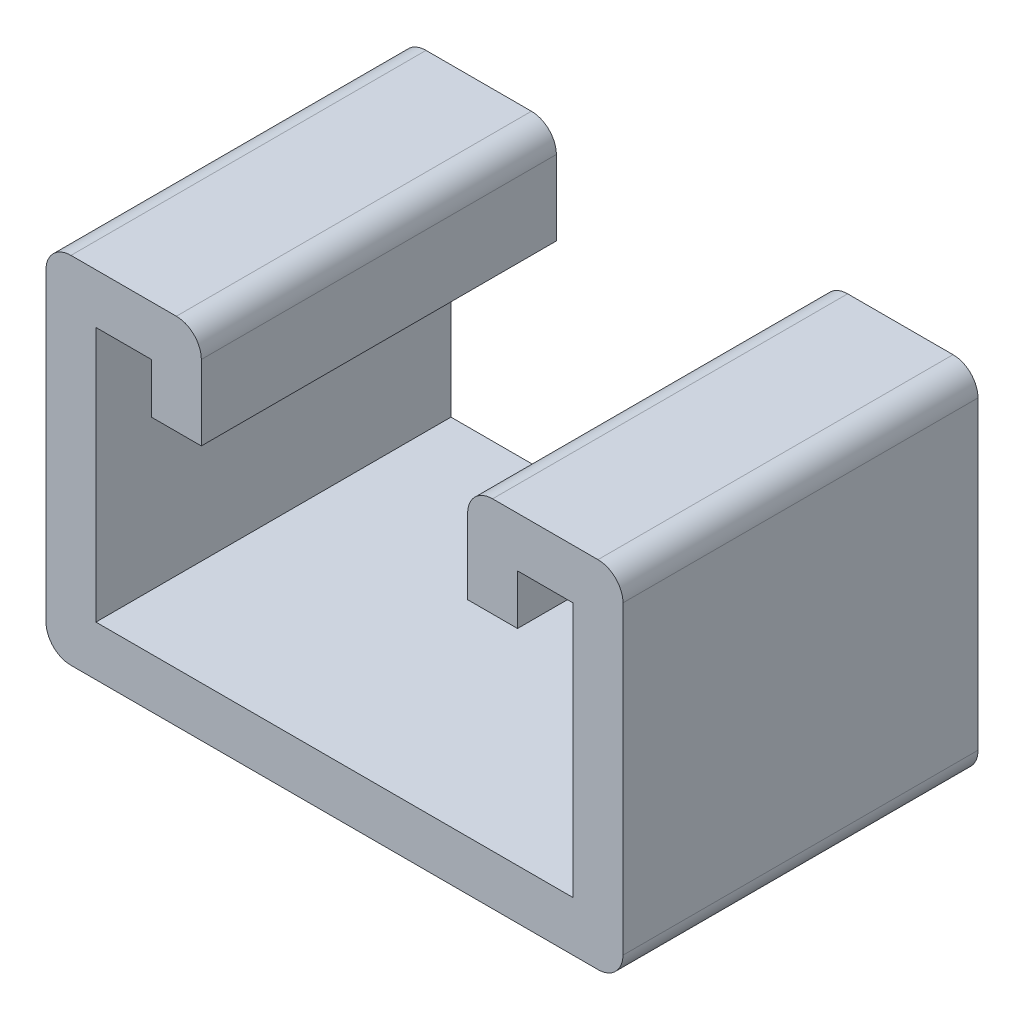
ISO-10303-21;
HEADER;
FILE_DESCRIPTION(('STEP AP214'),'2;1');
FILE_NAME('part.step','',(''),(''),'','','');
FILE_SCHEMA(('AUTOMOTIVE_DESIGN { 1 0 10303 214 1 1 1 1 }'));
ENDSEC;
DATA;
#1=APPLICATION_CONTEXT('core data for automotive mechanical design processes');
#2=APPLICATION_PROTOCOL_DEFINITION('international standard','automotive_design',2000,#1);
#3=PRODUCT_CONTEXT('',#1,'mechanical');
#4=PRODUCT('Part','Part','',(#3));
#5=PRODUCT_RELATED_PRODUCT_CATEGORY('part','',(#4));
#6=PRODUCT_DEFINITION_FORMATION('','',#4);
#7=PRODUCT_DEFINITION_CONTEXT('part definition',#1,'design');
#8=PRODUCT_DEFINITION('design','',#6,#7);
#9=PRODUCT_DEFINITION_SHAPE('','',#8);
#10=(LENGTH_UNIT() NAMED_UNIT(*) SI_UNIT(.MILLI.,.METRE.));
#11=(NAMED_UNIT(*) PLANE_ANGLE_UNIT() SI_UNIT($,.RADIAN.));
#12=(NAMED_UNIT(*) SI_UNIT($,.STERADIAN.) SOLID_ANGLE_UNIT());
#13=UNCERTAINTY_MEASURE_WITH_UNIT(LENGTH_MEASURE(1.E-05),#10,'distance_accuracy_value','');
#14=(GEOMETRIC_REPRESENTATION_CONTEXT(3) GLOBAL_UNCERTAINTY_ASSIGNED_CONTEXT((#13)) GLOBAL_UNIT_ASSIGNED_CONTEXT((#10,
#11,#12)) REPRESENTATION_CONTEXT('',''));
#15=CARTESIAN_POINT('',(0.,0.,0.));
#16=DIRECTION('',(0.,0.,1.));
#17=DIRECTION('',(1.,0.,0.));
#18=AXIS2_PLACEMENT_3D('',#15,#16,#17);
#19=CARTESIAN_POINT('',(9.525,5.55625,12.7));
#20=DIRECTION('',(0.,1.,0.));
#21=DIRECTION('',(0.,0.,1.));
#22=AXIS2_PLACEMENT_3D('',#19,#20,#21);
#23=PLANE('',#22);
#24=DIRECTION('',(1.,0.,0.));
#25=VECTOR('',#24,1.);
#26=CARTESIAN_POINT('',(9.525,5.55625,-12.7));
#27=LINE('',#26,#25);
#28=CARTESIAN_POINT('',(9.525,5.55625,-12.7));
#29=VERTEX_POINT('',#28);
#30=CARTESIAN_POINT('',(13.096875,5.55625,-12.7));
#31=VERTEX_POINT('',#30);
#32=EDGE_CURVE('E212',#29,#31,#27,.T.);
#33=ORIENTED_EDGE('',*,*,#32,.T.);
#34=DIRECTION('',(0.,0.,-1.));
#35=VECTOR('',#34,1.);
#36=CARTESIAN_POINT('',(13.096875,5.55625,12.7));
#37=LINE('',#36,#35);
#38=CARTESIAN_POINT('',(13.096875,5.55625,12.7));
#39=VERTEX_POINT('',#38);
#40=EDGE_CURVE('E11',#39,#31,#37,.T.);
#41=ORIENTED_EDGE('',*,*,#40,.F.);
#42=DIRECTION('',(1.,0.,0.));
#43=VECTOR('',#42,1.);
#44=CARTESIAN_POINT('',(9.525,5.55625,12.7));
#45=LINE('',#44,#43);
#46=CARTESIAN_POINT('',(9.525,5.55625,12.7));
#47=VERTEX_POINT('',#46);
#48=EDGE_CURVE('E254',#47,#39,#45,.T.);
#49=ORIENTED_EDGE('',*,*,#48,.F.);
#50=DIRECTION('',(0.,0.,-1.));
#51=VECTOR('',#50,1.);
#52=CARTESIAN_POINT('',(9.525,5.55625,12.7));
#53=LINE('',#52,#51);
#54=EDGE_CURVE('E208',#47,#29,#53,.T.);
#55=ORIENTED_EDGE('',*,*,#54,.T.);
#56=EDGE_LOOP('',(#33,#41,#49,#55));
#57=FACE_BOUND('',#56,.T.);
#58=ADVANCED_FACE('F32',(#57),#23,.F.);
#59=CARTESIAN_POINT('',(13.096875,9.128125,12.7));
#60=DIRECTION('',(-1.,0.,0.));
#61=DIRECTION('',(0.,0.,1.));
#62=AXIS2_PLACEMENT_3D('',#59,#60,#61);
#63=PLANE('',#62);
#64=DIRECTION('',(0.,1.,0.));
#65=VECTOR('',#64,1.);
#66=CARTESIAN_POINT('',(13.096875,9.128125,-12.7));
#67=LINE('',#66,#65);
#68=CARTESIAN_POINT('',(13.096875,9.128125,-12.7));
#69=VERTEX_POINT('',#68);
#70=EDGE_CURVE('E215',#31,#69,#67,.T.);
#71=ORIENTED_EDGE('',*,*,#70,.T.);
#72=DIRECTION('',(0.,0.,-1.));
#73=VECTOR('',#72,1.);
#74=CARTESIAN_POINT('',(13.096875,9.128125,12.7));
#75=LINE('',#74,#73);
#76=CARTESIAN_POINT('',(13.096875,9.128125,12.7));
#77=VERTEX_POINT('',#76);
#78=EDGE_CURVE('E40',#77,#69,#75,.T.);
#79=ORIENTED_EDGE('',*,*,#78,.F.);
#80=DIRECTION('',(0.,1.,0.));
#81=VECTOR('',#80,1.);
#82=CARTESIAN_POINT('',(13.096875,9.128125,12.7));
#83=LINE('',#82,#81);
#84=EDGE_CURVE('E133',#39,#77,#83,.T.);
#85=ORIENTED_EDGE('',*,*,#84,.F.);
#86=ORIENTED_EDGE('',*,*,#40,.T.);
#87=EDGE_LOOP('',(#71,#79,#85,#86));
#88=FACE_BOUND('',#87,.T.);
#89=ADVANCED_FACE('F382',(#88),#63,.F.);
#90=CARTESIAN_POINT('',(17.065625,9.128125,12.7));
#91=DIRECTION('',(0.,1.,0.));
#92=DIRECTION('',(0.,0.,1.));
#93=AXIS2_PLACEMENT_3D('',#90,#91,#92);
#94=PLANE('',#93);
#95=DIRECTION('',(1.,0.,0.));
#96=VECTOR('',#95,1.);
#97=CARTESIAN_POINT('',(17.065625,9.128125,-12.7));
#98=LINE('',#97,#96);
#99=CARTESIAN_POINT('',(17.065625,9.128125,-12.7));
#100=VERTEX_POINT('',#99);
#101=EDGE_CURVE('E217',#69,#100,#98,.T.);
#102=ORIENTED_EDGE('',*,*,#101,.T.);
#103=DIRECTION('',(0.,0.,-1.));
#104=VECTOR('',#103,1.);
#105=CARTESIAN_POINT('',(17.065625,9.128125,12.7));
#106=LINE('',#105,#104);
#107=CARTESIAN_POINT('',(17.065625,9.128125,12.7));
#108=VERTEX_POINT('',#107);
#109=EDGE_CURVE('E303',#108,#100,#106,.T.);
#110=ORIENTED_EDGE('',*,*,#109,.F.);
#111=DIRECTION('',(1.,0.,0.));
#112=VECTOR('',#111,1.);
#113=CARTESIAN_POINT('',(17.065625,9.128125,12.7));
#114=LINE('',#113,#112);
#115=EDGE_CURVE('E311',#77,#108,#114,.T.);
#116=ORIENTED_EDGE('',*,*,#115,.F.);
#117=ORIENTED_EDGE('',*,*,#78,.T.);
#118=EDGE_LOOP('',(#102,#110,#116,#117));
#119=FACE_BOUND('',#118,.T.);
#120=ADVANCED_FACE('F309',(#119),#94,.F.);
#121=CARTESIAN_POINT('',(17.065625,-9.128125,12.7));
#122=DIRECTION('',(1.,0.,0.));
#123=DIRECTION('',(0.,1.,0.));
#124=AXIS2_PLACEMENT_3D('',#121,#122,#123);
#125=PLANE('',#124);
#126=DIRECTION('',(0.,-1.,0.));
#127=VECTOR('',#126,1.);
#128=CARTESIAN_POINT('',(17.065625,-9.128125,-12.7));
#129=LINE('',#128,#127);
#130=CARTESIAN_POINT('',(17.065625,-9.128125,-12.7));
#131=VERTEX_POINT('',#130);
#132=EDGE_CURVE('E219',#100,#131,#129,.T.);
#133=ORIENTED_EDGE('',*,*,#132,.T.);
#134=DIRECTION('',(0.,0.,-1.));
#135=VECTOR('',#134,1.);
#136=CARTESIAN_POINT('',(17.065625,-9.128125,12.7));
#137=LINE('',#136,#135);
#138=CARTESIAN_POINT('',(17.065625,-9.128125,12.7));
#139=VERTEX_POINT('',#138);
#140=EDGE_CURVE('E300',#139,#131,#137,.T.);
#141=ORIENTED_EDGE('',*,*,#140,.F.);
#142=DIRECTION('',(0.,-1.,0.));
#143=VECTOR('',#142,1.);
#144=CARTESIAN_POINT('',(17.065625,-9.128125,12.7));
#145=LINE('',#144,#143);
#146=EDGE_CURVE('E329',#108,#139,#145,.T.);
#147=ORIENTED_EDGE('',*,*,#146,.F.);
#148=ORIENTED_EDGE('',*,*,#109,.T.);
#149=EDGE_LOOP('',(#133,#141,#147,#148));
#150=FACE_BOUND('',#149,.T.);
#151=ADVANCED_FACE('F320',(#150),#125,.F.);
#152=CARTESIAN_POINT('',(-17.065625,-9.128125,12.7));
#153=DIRECTION('',(0.,-1.,0.));
#154=DIRECTION('',(0.,0.,-1.));
#155=AXIS2_PLACEMENT_3D('',#152,#153,#154);
#156=PLANE('',#155);
#157=DIRECTION('',(-1.,0.,0.));
#158=VECTOR('',#157,1.);
#159=CARTESIAN_POINT('',(-17.065625,-9.128125,-12.7));
#160=LINE('',#159,#158);
#161=CARTESIAN_POINT('',(-17.065625,-9.128125,-12.7));
#162=VERTEX_POINT('',#161);
#163=EDGE_CURVE('E221',#131,#162,#160,.T.);
#164=ORIENTED_EDGE('',*,*,#163,.T.);
#165=DIRECTION('',(0.,0.,-1.));
#166=VECTOR('',#165,1.);
#167=CARTESIAN_POINT('',(-17.065625,-9.128125,12.7));
#168=LINE('',#167,#166);
#169=CARTESIAN_POINT('',(-17.065625,-9.128125,12.7));
#170=VERTEX_POINT('',#169);
#171=EDGE_CURVE('E297',#170,#162,#168,.T.);
#172=ORIENTED_EDGE('',*,*,#171,.F.);
#173=DIRECTION('',(-1.,0.,0.));
#174=VECTOR('',#173,1.);
#175=CARTESIAN_POINT('',(-17.065625,-9.128125,12.7));
#176=LINE('',#175,#174);
#177=EDGE_CURVE('E326',#139,#170,#176,.T.);
#178=ORIENTED_EDGE('',*,*,#177,.F.);
#179=ORIENTED_EDGE('',*,*,#140,.T.);
#180=EDGE_LOOP('',(#164,#172,#178,#179));
#181=FACE_BOUND('',#180,.T.);
#182=ADVANCED_FACE('F324',(#181),#156,.F.);
#183=CARTESIAN_POINT('',(-17.065625,9.128125,12.7));
#184=DIRECTION('',(-1.,0.,0.));
#185=DIRECTION('',(0.,-1.,0.));
#186=AXIS2_PLACEMENT_3D('',#183,#184,#185);
#187=PLANE('',#186);
#188=DIRECTION('',(0.,1.,0.));
#189=VECTOR('',#188,1.);
#190=CARTESIAN_POINT('',(-17.065625,9.128125,-12.7));
#191=LINE('',#190,#189);
#192=CARTESIAN_POINT('',(-17.065625,9.128125,-12.7));
#193=VERTEX_POINT('',#192);
#194=EDGE_CURVE('E223',#162,#193,#191,.T.);
#195=ORIENTED_EDGE('',*,*,#194,.T.);
#196=DIRECTION('',(0.,0.,-1.));
#197=VECTOR('',#196,1.);
#198=CARTESIAN_POINT('',(-17.065625,9.128125,12.7));
#199=LINE('',#198,#197);
#200=CARTESIAN_POINT('',(-17.065625,9.128125,12.7));
#201=VERTEX_POINT('',#200);
#202=EDGE_CURVE('E294',#201,#193,#199,.T.);
#203=ORIENTED_EDGE('',*,*,#202,.F.);
#204=DIRECTION('',(0.,1.,0.));
#205=VECTOR('',#204,1.);
#206=CARTESIAN_POINT('',(-17.065625,9.128125,12.7));
#207=LINE('',#206,#205);
#208=EDGE_CURVE('E328',#170,#201,#207,.T.);
#209=ORIENTED_EDGE('',*,*,#208,.F.);
#210=ORIENTED_EDGE('',*,*,#171,.T.);
#211=EDGE_LOOP('',(#195,#203,#209,#210));
#212=FACE_BOUND('',#211,.T.);
#213=ADVANCED_FACE('F395',(#212),#187,.F.);
#214=CARTESIAN_POINT('',(-13.096875,9.128125,12.7));
#215=DIRECTION('',(0.,1.,0.));
#216=DIRECTION('',(0.,0.,1.));
#217=AXIS2_PLACEMENT_3D('',#214,#215,#216);
#218=PLANE('',#217);
#219=DIRECTION('',(1.,0.,0.));
#220=VECTOR('',#219,1.);
#221=CARTESIAN_POINT('',(-13.096875,9.128125,-12.7));
#222=LINE('',#221,#220);
#223=CARTESIAN_POINT('',(-13.096875,9.128125,-12.7));
#224=VERTEX_POINT('',#223);
#225=EDGE_CURVE('E225',#193,#224,#222,.T.);
#226=ORIENTED_EDGE('',*,*,#225,.T.);
#227=DIRECTION('',(0.,0.,-1.));
#228=VECTOR('',#227,1.);
#229=CARTESIAN_POINT('',(-13.096875,9.128125,12.7));
#230=LINE('',#229,#228);
#231=CARTESIAN_POINT('',(-13.096875,9.128125,12.7));
#232=VERTEX_POINT('',#231);
#233=EDGE_CURVE('E291',#232,#224,#230,.T.);
#234=ORIENTED_EDGE('',*,*,#233,.F.);
#235=DIRECTION('',(1.,0.,0.));
#236=VECTOR('',#235,1.);
#237=CARTESIAN_POINT('',(-13.096875,9.128125,12.7));
#238=LINE('',#237,#236);
#239=EDGE_CURVE('E331',#201,#232,#238,.T.);
#240=ORIENTED_EDGE('',*,*,#239,.F.);
#241=ORIENTED_EDGE('',*,*,#202,.T.);
#242=EDGE_LOOP('',(#226,#234,#240,#241));
#243=FACE_BOUND('',#242,.T.);
#244=ADVANCED_FACE('F398',(#243),#218,.F.);
#245=CARTESIAN_POINT('',(-13.096875,9.128125,12.7));
#246=DIRECTION('',(1.,0.,0.));
#247=DIRECTION('',(0.,0.,-1.));
#248=AXIS2_PLACEMENT_3D('',#245,#246,#247);
#249=PLANE('',#248);
#250=DIRECTION('',(0.,-1.,0.));
#251=VECTOR('',#250,1.);
#252=CARTESIAN_POINT('',(-13.096875,9.128125,-12.7));
#253=LINE('',#252,#251);
#254=CARTESIAN_POINT('',(-13.096875,5.55625,-12.7));
#255=VERTEX_POINT('',#254);
#256=EDGE_CURVE('E227',#224,#255,#253,.T.);
#257=ORIENTED_EDGE('',*,*,#256,.T.);
#258=DIRECTION('',(0.,0.,-1.));
#259=VECTOR('',#258,1.);
#260=CARTESIAN_POINT('',(-13.096875,5.55625,12.7));
#261=LINE('',#260,#259);
#262=CARTESIAN_POINT('',(-13.096875,5.55625,12.7));
#263=VERTEX_POINT('',#262);
#264=EDGE_CURVE('E288',#263,#255,#261,.T.);
#265=ORIENTED_EDGE('',*,*,#264,.F.);
#266=DIRECTION('',(0.,-1.,0.));
#267=VECTOR('',#266,1.);
#268=CARTESIAN_POINT('',(-13.096875,9.128125,12.7));
#269=LINE('',#268,#267);
#270=EDGE_CURVE('E337',#232,#263,#269,.T.);
#271=ORIENTED_EDGE('',*,*,#270,.F.);
#272=ORIENTED_EDGE('',*,*,#233,.T.);
#273=EDGE_LOOP('',(#257,#265,#271,#272));
#274=FACE_BOUND('',#273,.T.);
#275=ADVANCED_FACE('F402',(#274),#249,.F.);
#276=CARTESIAN_POINT('',(-13.096875,5.55625,12.7));
#277=DIRECTION('',(0.,1.,0.));
#278=DIRECTION('',(0.,0.,1.));
#279=AXIS2_PLACEMENT_3D('',#276,#277,#278);
#280=PLANE('',#279);
#281=DIRECTION('',(1.,0.,0.));
#282=VECTOR('',#281,1.);
#283=CARTESIAN_POINT('',(-13.096875,5.55625,-12.7));
#284=LINE('',#283,#282);
#285=CARTESIAN_POINT('',(-9.525,5.55625,-12.7));
#286=VERTEX_POINT('',#285);
#287=EDGE_CURVE('E229',#255,#286,#284,.T.);
#288=ORIENTED_EDGE('',*,*,#287,.T.);
#289=DIRECTION('',(0.,0.,-1.));
#290=VECTOR('',#289,1.);
#291=CARTESIAN_POINT('',(-9.525,5.55625,12.7));
#292=LINE('',#291,#290);
#293=CARTESIAN_POINT('',(-9.525,5.55625,12.7));
#294=VERTEX_POINT('',#293);
#295=EDGE_CURVE('E285',#294,#286,#292,.T.);
#296=ORIENTED_EDGE('',*,*,#295,.F.);
#297=DIRECTION('',(1.,0.,0.));
#298=VECTOR('',#297,1.);
#299=CARTESIAN_POINT('',(-13.096875,5.55625,12.7));
#300=LINE('',#299,#298);
#301=EDGE_CURVE('E339',#263,#294,#300,.T.);
#302=ORIENTED_EDGE('',*,*,#301,.F.);
#303=ORIENTED_EDGE('',*,*,#264,.T.);
#304=EDGE_LOOP('',(#288,#296,#302,#303));
#305=FACE_BOUND('',#304,.T.);
#306=ADVANCED_FACE('F406',(#305),#280,.F.);
#307=CARTESIAN_POINT('',(-9.525,10.9140625,12.7));
#308=DIRECTION('',(-1.,0.,0.));
#309=DIRECTION('',(0.,0.,1.));
#310=AXIS2_PLACEMENT_3D('',#307,#308,#309);
#311=PLANE('',#310);
#312=DIRECTION('',(0.,1.,0.));
#313=VECTOR('',#312,1.);
#314=CARTESIAN_POINT('',(-9.525,10.9140625,-12.7));
#315=LINE('',#314,#313);
#316=CARTESIAN_POINT('',(-9.525,10.9140625,-12.7));
#317=VERTEX_POINT('',#316);
#318=EDGE_CURVE('E231',#286,#317,#315,.T.);
#319=ORIENTED_EDGE('',*,*,#318,.T.);
#320=DIRECTION('',(0.,0.,-1.));
#321=VECTOR('',#320,1.);
#322=CARTESIAN_POINT('',(-9.525,10.9140625,12.7));
#323=LINE('',#322,#321);
#324=CARTESIAN_POINT('',(-9.525,10.9140625,12.7));
#325=VERTEX_POINT('',#324);
#326=EDGE_CURVE('E282',#325,#317,#323,.T.);
#327=ORIENTED_EDGE('',*,*,#326,.F.);
#328=DIRECTION('',(0.,1.,0.));
#329=VECTOR('',#328,1.);
#330=CARTESIAN_POINT('',(-9.525,10.9140625,12.7));
#331=LINE('',#330,#329);
#332=EDGE_CURVE('E341',#294,#325,#331,.T.);
#333=ORIENTED_EDGE('',*,*,#332,.F.);
#334=ORIENTED_EDGE('',*,*,#295,.T.);
#335=EDGE_LOOP('',(#319,#327,#333,#334));
#336=FACE_BOUND('',#335,.T.);
#337=ADVANCED_FACE('F410',(#336),#311,.F.);
#338=CARTESIAN_POINT('',(-11.3109375,10.9140625,12.7));
#339=DIRECTION('',(0.,0.,-1.));
#340=DIRECTION('',(-1.,0.,0.));
#341=AXIS2_PLACEMENT_3D('',#338,#339,#340);
#342=CYLINDRICAL_SURFACE('',#341,1.7859375);
#343=CARTESIAN_POINT('',(-11.3109375,10.9140625,-12.7));
#344=DIRECTION('',(0.,0.,1.));
#345=DIRECTION('',(-1.,0.,0.));
#346=AXIS2_PLACEMENT_3D('',#343,#344,#345);
#347=CIRCLE('',#346,1.7859375);
#348=CARTESIAN_POINT('',(-11.3109375,12.7,-12.7));
#349=VERTEX_POINT('',#348);
#350=EDGE_CURVE('E233',#317,#349,#347,.T.);
#351=ORIENTED_EDGE('',*,*,#350,.T.);
#352=DIRECTION('',(0.,0.,-1.));
#353=VECTOR('',#352,1.);
#354=CARTESIAN_POINT('',(-11.3109375,12.7,12.7));
#355=LINE('',#354,#353);
#356=CARTESIAN_POINT('',(-11.3109375,12.7,12.7));
#357=VERTEX_POINT('',#356);
#358=EDGE_CURVE('E279',#357,#349,#355,.T.);
#359=ORIENTED_EDGE('',*,*,#358,.F.);
#360=CARTESIAN_POINT('',(-11.3109375,10.9140625,12.7));
#361=DIRECTION('',(0.,0.,1.));
#362=DIRECTION('',(-1.,0.,0.));
#363=AXIS2_PLACEMENT_3D('',#360,#361,#362);
#364=CIRCLE('',#363,1.7859375);
#365=EDGE_CURVE('E343',#325,#357,#364,.T.);
#366=ORIENTED_EDGE('',*,*,#365,.F.);
#367=ORIENTED_EDGE('',*,*,#326,.T.);
#368=EDGE_LOOP('',(#351,#359,#366,#367));
#369=FACE_BOUND('',#368,.T.);
#370=ADVANCED_FACE('F414',(#369),#342,.T.);
#371=CARTESIAN_POINT('',(-11.3109375,12.7,12.7));
#372=DIRECTION('',(0.,-1.,0.));
#373=DIRECTION('',(0.,0.,-1.));
#374=AXIS2_PLACEMENT_3D('',#371,#372,#373);
#375=PLANE('',#374);
#376=DIRECTION('',(-1.,0.,0.));
#377=VECTOR('',#376,1.);
#378=CARTESIAN_POINT('',(-11.3109375,12.7,-12.7));
#379=LINE('',#378,#377);
#380=CARTESIAN_POINT('',(-18.8515625,12.7,-12.7));
#381=VERTEX_POINT('',#380);
#382=EDGE_CURVE('E235',#349,#381,#379,.T.);
#383=ORIENTED_EDGE('',*,*,#382,.T.);
#384=DIRECTION('',(0.,0.,-1.));
#385=VECTOR('',#384,1.);
#386=CARTESIAN_POINT('',(-18.8515625,12.7,12.7));
#387=LINE('',#386,#385);
#388=CARTESIAN_POINT('',(-18.8515625,12.7,12.7));
#389=VERTEX_POINT('',#388);
#390=EDGE_CURVE('E276',#389,#381,#387,.T.);
#391=ORIENTED_EDGE('',*,*,#390,.F.);
#392=DIRECTION('',(-1.,0.,0.));
#393=VECTOR('',#392,1.);
#394=CARTESIAN_POINT('',(-11.3109375,12.7,12.7));
#395=LINE('',#394,#393);
#396=EDGE_CURVE('E345',#357,#389,#395,.T.);
#397=ORIENTED_EDGE('',*,*,#396,.F.);
#398=ORIENTED_EDGE('',*,*,#358,.T.);
#399=EDGE_LOOP('',(#383,#391,#397,#398));
#400=FACE_BOUND('',#399,.T.);
#401=ADVANCED_FACE('F418',(#400),#375,.F.);
#402=CARTESIAN_POINT('',(-18.8515625,10.9140625,12.7));
#403=DIRECTION('',(0.,0.,-1.));
#404=DIRECTION('',(-1.,0.,0.));
#405=AXIS2_PLACEMENT_3D('',#402,#403,#404);
#406=CYLINDRICAL_SURFACE('',#405,1.7859375);
#407=CARTESIAN_POINT('',(-18.8515625,10.9140625,-12.7));
#408=DIRECTION('',(0.,0.,1.));
#409=DIRECTION('',(-1.,0.,0.));
#410=AXIS2_PLACEMENT_3D('',#407,#408,#409);
#411=CIRCLE('',#410,1.7859375);
#412=CARTESIAN_POINT('',(-20.6375,10.9140625,-12.7));
#413=VERTEX_POINT('',#412);
#414=EDGE_CURVE('E237',#381,#413,#411,.T.);
#415=ORIENTED_EDGE('',*,*,#414,.T.);
#416=DIRECTION('',(0.,0.,-1.));
#417=VECTOR('',#416,1.);
#418=CARTESIAN_POINT('',(-20.6375,10.9140625,12.7));
#419=LINE('',#418,#417);
#420=CARTESIAN_POINT('',(-20.6375,10.9140625,12.7));
#421=VERTEX_POINT('',#420);
#422=EDGE_CURVE('E273',#421,#413,#419,.T.);
#423=ORIENTED_EDGE('',*,*,#422,.F.);
#424=CARTESIAN_POINT('',(-18.8515625,10.9140625,12.7));
#425=DIRECTION('',(0.,0.,1.));
#426=DIRECTION('',(-1.,0.,0.));
#427=AXIS2_PLACEMENT_3D('',#424,#425,#426);
#428=CIRCLE('',#427,1.7859375);
#429=EDGE_CURVE('E347',#389,#421,#428,.T.);
#430=ORIENTED_EDGE('',*,*,#429,.F.);
#431=ORIENTED_EDGE('',*,*,#390,.T.);
#432=EDGE_LOOP('',(#415,#423,#430,#431));
#433=FACE_BOUND('',#432,.T.);
#434=ADVANCED_FACE('F422',(#433),#406,.T.);
#435=CARTESIAN_POINT('',(-20.6375,10.9140625,12.7));
#436=DIRECTION('',(1.,0.,0.));
#437=DIRECTION('',(0.,0.,-1.));
#438=AXIS2_PLACEMENT_3D('',#435,#436,#437);
#439=PLANE('',#438);
#440=DIRECTION('',(0.,-1.,0.));
#441=VECTOR('',#440,1.);
#442=CARTESIAN_POINT('',(-20.6375,10.9140625,-12.7));
#443=LINE('',#442,#441);
#444=CARTESIAN_POINT('',(-20.6375,-10.9140625,-12.7));
#445=VERTEX_POINT('',#444);
#446=EDGE_CURVE('E239',#413,#445,#443,.T.);
#447=ORIENTED_EDGE('',*,*,#446,.T.);
#448=DIRECTION('',(0.,0.,-1.));
#449=VECTOR('',#448,1.);
#450=CARTESIAN_POINT('',(-20.6375,-10.9140625,12.7));
#451=LINE('',#450,#449);
#452=CARTESIAN_POINT('',(-20.6375,-10.9140625,12.7));
#453=VERTEX_POINT('',#452);
#454=EDGE_CURVE('E270',#453,#445,#451,.T.);
#455=ORIENTED_EDGE('',*,*,#454,.F.);
#456=DIRECTION('',(0.,-1.,0.));
#457=VECTOR('',#456,1.);
#458=CARTESIAN_POINT('',(-20.6375,10.9140625,12.7));
#459=LINE('',#458,#457);
#460=EDGE_CURVE('E349',#421,#453,#459,.T.);
#461=ORIENTED_EDGE('',*,*,#460,.F.);
#462=ORIENTED_EDGE('',*,*,#422,.T.);
#463=EDGE_LOOP('',(#447,#455,#461,#462));
#464=FACE_BOUND('',#463,.T.);
#465=ADVANCED_FACE('F426',(#464),#439,.F.);
#466=CARTESIAN_POINT('',(-18.8515625,-10.9140625,12.7));
#467=DIRECTION('',(0.,0.,-1.));
#468=DIRECTION('',(-1.,0.,0.));
#469=AXIS2_PLACEMENT_3D('',#466,#467,#468);
#470=CYLINDRICAL_SURFACE('',#469,1.7859375);
#471=CARTESIAN_POINT('',(-18.8515625,-10.9140625,-12.7));
#472=DIRECTION('',(0.,0.,1.));
#473=DIRECTION('',(-1.,0.,0.));
#474=AXIS2_PLACEMENT_3D('',#471,#472,#473);
#475=CIRCLE('',#474,1.7859375);
#476=CARTESIAN_POINT('',(-18.8515625,-12.7,-12.7));
#477=VERTEX_POINT('',#476);
#478=EDGE_CURVE('E241',#445,#477,#475,.T.);
#479=ORIENTED_EDGE('',*,*,#478,.T.);
#480=DIRECTION('',(0.,0.,-1.));
#481=VECTOR('',#480,1.);
#482=CARTESIAN_POINT('',(-18.8515625,-12.7,12.7));
#483=LINE('',#482,#481);
#484=CARTESIAN_POINT('',(-18.8515625,-12.7,12.7));
#485=VERTEX_POINT('',#484);
#486=EDGE_CURVE('E267',#485,#477,#483,.T.);
#487=ORIENTED_EDGE('',*,*,#486,.F.);
#488=CARTESIAN_POINT('',(-18.8515625,-10.9140625,12.7));
#489=DIRECTION('',(0.,0.,1.));
#490=DIRECTION('',(-1.,0.,0.));
#491=AXIS2_PLACEMENT_3D('',#488,#489,#490);
#492=CIRCLE('',#491,1.7859375);
#493=EDGE_CURVE('E351',#453,#485,#492,.T.);
#494=ORIENTED_EDGE('',*,*,#493,.F.);
#495=ORIENTED_EDGE('',*,*,#454,.T.);
#496=EDGE_LOOP('',(#479,#487,#494,#495));
#497=FACE_BOUND('',#496,.T.);
#498=ADVANCED_FACE('F430',(#497),#470,.T.);
#499=CARTESIAN_POINT('',(-18.8515625,-12.7,12.7));
#500=DIRECTION('',(0.,1.,0.));
#501=DIRECTION('',(-1.,0.,0.));
#502=AXIS2_PLACEMENT_3D('',#499,#500,#501);
#503=PLANE('',#502);
#504=DIRECTION('',(1.,0.,0.));
#505=VECTOR('',#504,1.);
#506=CARTESIAN_POINT('',(-18.8515625,-12.7,-12.7));
#507=LINE('',#506,#505);
#508=CARTESIAN_POINT('',(18.8515625,-12.7,-12.7));
#509=VERTEX_POINT('',#508);
#510=EDGE_CURVE('E243',#477,#509,#507,.T.);
#511=ORIENTED_EDGE('',*,*,#510,.T.);
#512=DIRECTION('',(0.,0.,-1.));
#513=VECTOR('',#512,1.);
#514=CARTESIAN_POINT('',(18.8515625,-12.7,12.7));
#515=LINE('',#514,#513);
#516=CARTESIAN_POINT('',(18.8515625,-12.7,12.7));
#517=VERTEX_POINT('',#516);
#518=EDGE_CURVE('E264',#517,#509,#515,.T.);
#519=ORIENTED_EDGE('',*,*,#518,.F.);
#520=DIRECTION('',(1.,0.,0.));
#521=VECTOR('',#520,1.);
#522=CARTESIAN_POINT('',(-18.8515625,-12.7,12.7));
#523=LINE('',#522,#521);
#524=EDGE_CURVE('E353',#485,#517,#523,.T.);
#525=ORIENTED_EDGE('',*,*,#524,.F.);
#526=ORIENTED_EDGE('',*,*,#486,.T.);
#527=EDGE_LOOP('',(#511,#519,#525,#526));
#528=FACE_BOUND('',#527,.T.);
#529=ADVANCED_FACE('F434',(#528),#503,.F.);
#530=CARTESIAN_POINT('',(18.8515625,-10.9140625,12.7));
#531=DIRECTION('',(0.,0.,-1.));
#532=DIRECTION('',(-1.,0.,0.));
#533=AXIS2_PLACEMENT_3D('',#530,#531,#532);
#534=CYLINDRICAL_SURFACE('',#533,1.7859375);
#535=CARTESIAN_POINT('',(18.8515625,-10.9140625,-12.7));
#536=DIRECTION('',(0.,0.,1.));
#537=DIRECTION('',(-1.,0.,0.));
#538=AXIS2_PLACEMENT_3D('',#535,#536,#537);
#539=CIRCLE('',#538,1.7859375);
#540=CARTESIAN_POINT('',(20.6375,-10.9140625,-12.7));
#541=VERTEX_POINT('',#540);
#542=EDGE_CURVE('E245',#509,#541,#539,.T.);
#543=ORIENTED_EDGE('',*,*,#542,.T.);
#544=DIRECTION('',(0.,0.,-1.));
#545=VECTOR('',#544,1.);
#546=CARTESIAN_POINT('',(20.6375,-10.9140625,12.7));
#547=LINE('',#546,#545);
#548=CARTESIAN_POINT('',(20.6375,-10.9140625,12.7));
#549=VERTEX_POINT('',#548);
#550=EDGE_CURVE('E261',#549,#541,#547,.T.);
#551=ORIENTED_EDGE('',*,*,#550,.F.);
#552=CARTESIAN_POINT('',(18.8515625,-10.9140625,12.7));
#553=DIRECTION('',(0.,0.,1.));
#554=DIRECTION('',(-1.,0.,0.));
#555=AXIS2_PLACEMENT_3D('',#552,#553,#554);
#556=CIRCLE('',#555,1.7859375);
#557=EDGE_CURVE('E355',#517,#549,#556,.T.);
#558=ORIENTED_EDGE('',*,*,#557,.F.);
#559=ORIENTED_EDGE('',*,*,#518,.T.);
#560=EDGE_LOOP('',(#543,#551,#558,#559));
#561=FACE_BOUND('',#560,.T.);
#562=ADVANCED_FACE('F438',(#561),#534,.T.);
#563=CARTESIAN_POINT('',(20.6375,-10.9140625,12.7));
#564=DIRECTION('',(-1.,0.,0.));
#565=DIRECTION('',(0.,-1.,0.));
#566=AXIS2_PLACEMENT_3D('',#563,#564,#565);
#567=PLANE('',#566);
#568=DIRECTION('',(0.,1.,0.));
#569=VECTOR('',#568,1.);
#570=CARTESIAN_POINT('',(20.6375,-10.9140625,-12.7));
#571=LINE('',#570,#569);
#572=CARTESIAN_POINT('',(20.6375,10.9140625,-12.7));
#573=VERTEX_POINT('',#572);
#574=EDGE_CURVE('E247',#541,#573,#571,.T.);
#575=ORIENTED_EDGE('',*,*,#574,.T.);
#576=DIRECTION('',(0.,0.,-1.));
#577=VECTOR('',#576,1.);
#578=CARTESIAN_POINT('',(20.6375,10.9140625,12.7));
#579=LINE('',#578,#577);
#580=CARTESIAN_POINT('',(20.6375,10.9140625,12.7));
#581=VERTEX_POINT('',#580);
#582=EDGE_CURVE('E258',#581,#573,#579,.T.);
#583=ORIENTED_EDGE('',*,*,#582,.F.);
#584=DIRECTION('',(0.,1.,0.));
#585=VECTOR('',#584,1.);
#586=CARTESIAN_POINT('',(20.6375,-10.9140625,12.7));
#587=LINE('',#586,#585);
#588=EDGE_CURVE('E357',#549,#581,#587,.T.);
#589=ORIENTED_EDGE('',*,*,#588,.F.);
#590=ORIENTED_EDGE('',*,*,#550,.T.);
#591=EDGE_LOOP('',(#575,#583,#589,#590));
#592=FACE_BOUND('',#591,.T.);
#593=ADVANCED_FACE('F363',(#592),#567,.F.);
#594=CARTESIAN_POINT('',(18.8515625,10.9140625,12.7));
#595=DIRECTION('',(0.,0.,-1.));
#596=DIRECTION('',(-1.,0.,0.));
#597=AXIS2_PLACEMENT_3D('',#594,#595,#596);
#598=CYLINDRICAL_SURFACE('',#597,1.7859375);
#599=CARTESIAN_POINT('',(18.8515625,10.9140625,-12.7));
#600=DIRECTION('',(0.,0.,1.));
#601=DIRECTION('',(-1.,0.,0.));
#602=AXIS2_PLACEMENT_3D('',#599,#600,#601);
#603=CIRCLE('',#602,1.7859375);
#604=CARTESIAN_POINT('',(18.8515625,12.7,-12.7));
#605=VERTEX_POINT('',#604);
#606=EDGE_CURVE('E249',#573,#605,#603,.T.);
#607=ORIENTED_EDGE('',*,*,#606,.T.);
#608=DIRECTION('',(0.,0.,-1.));
#609=VECTOR('',#608,1.);
#610=CARTESIAN_POINT('',(18.8515625,12.7,12.7));
#611=LINE('',#610,#609);
#612=CARTESIAN_POINT('',(18.8515625,12.7,12.7));
#613=VERTEX_POINT('',#612);
#614=EDGE_CURVE('E203',#613,#605,#611,.T.);
#615=ORIENTED_EDGE('',*,*,#614,.F.);
#616=CARTESIAN_POINT('',(18.8515625,10.9140625,12.7));
#617=DIRECTION('',(0.,0.,1.));
#618=DIRECTION('',(-1.,0.,0.));
#619=AXIS2_PLACEMENT_3D('',#616,#617,#618);
#620=CIRCLE('',#619,1.7859375);
#621=EDGE_CURVE('E194',#581,#613,#620,.T.);
#622=ORIENTED_EDGE('',*,*,#621,.F.);
#623=ORIENTED_EDGE('',*,*,#582,.T.);
#624=EDGE_LOOP('',(#607,#615,#622,#623));
#625=FACE_BOUND('',#624,.T.);
#626=ADVANCED_FACE('F367',(#625),#598,.T.);
#627=CARTESIAN_POINT('',(18.8515625,12.7,12.7));
#628=DIRECTION('',(0.,-1.,0.));
#629=DIRECTION('',(0.,0.,-1.));
#630=AXIS2_PLACEMENT_3D('',#627,#628,#629);
#631=PLANE('',#630);
#632=DIRECTION('',(-1.,0.,0.));
#633=VECTOR('',#632,1.);
#634=CARTESIAN_POINT('',(18.8515625,12.7,-12.7));
#635=LINE('',#634,#633);
#636=CARTESIAN_POINT('',(11.3109375,12.7,-12.7));
#637=VERTEX_POINT('',#636);
#638=EDGE_CURVE('E202',#605,#637,#635,.T.);
#639=ORIENTED_EDGE('',*,*,#638,.T.);
#640=DIRECTION('',(0.,0.,-1.));
#641=VECTOR('',#640,1.);
#642=CARTESIAN_POINT('',(11.3109375,12.7,12.7));
#643=LINE('',#642,#641);
#644=CARTESIAN_POINT('',(11.3109375,12.7,12.7));
#645=VERTEX_POINT('',#644);
#646=EDGE_CURVE('E199',#645,#637,#643,.T.);
#647=ORIENTED_EDGE('',*,*,#646,.F.);
#648=DIRECTION('',(-1.,0.,0.));
#649=VECTOR('',#648,1.);
#650=CARTESIAN_POINT('',(18.8515625,12.7,12.7));
#651=LINE('',#650,#649);
#652=EDGE_CURVE('E188',#613,#645,#651,.T.);
#653=ORIENTED_EDGE('',*,*,#652,.F.);
#654=ORIENTED_EDGE('',*,*,#614,.T.);
#655=EDGE_LOOP('',(#639,#647,#653,#654));
#656=FACE_BOUND('',#655,.T.);
#657=ADVANCED_FACE('F200',(#656),#631,.F.);
#658=CARTESIAN_POINT('',(11.3109375,10.9140625,12.7));
#659=DIRECTION('',(0.,0.,-1.));
#660=DIRECTION('',(-1.,0.,0.));
#661=AXIS2_PLACEMENT_3D('',#658,#659,#660);
#662=CYLINDRICAL_SURFACE('',#661,1.7859375);
#663=CARTESIAN_POINT('',(11.3109375,10.9140625,-12.7));
#664=DIRECTION('',(0.,0.,1.));
#665=DIRECTION('',(-1.,0.,0.));
#666=AXIS2_PLACEMENT_3D('',#663,#664,#665);
#667=CIRCLE('',#666,1.7859375);
#668=CARTESIAN_POINT('',(9.525,10.9140625,-12.7));
#669=VERTEX_POINT('',#668);
#670=EDGE_CURVE('E119',#637,#669,#667,.T.);
#671=ORIENTED_EDGE('',*,*,#670,.T.);
#672=DIRECTION('',(0.,0.,-1.));
#673=VECTOR('',#672,1.);
#674=CARTESIAN_POINT('',(9.525,10.9140625,12.7));
#675=LINE('',#674,#673);
#676=CARTESIAN_POINT('',(9.525,10.9140625,12.7));
#677=VERTEX_POINT('',#676);
#678=EDGE_CURVE('E204',#677,#669,#675,.T.);
#679=ORIENTED_EDGE('',*,*,#678,.F.);
#680=CARTESIAN_POINT('',(11.3109375,10.9140625,12.7));
#681=DIRECTION('',(0.,0.,1.));
#682=DIRECTION('',(-1.,0.,0.));
#683=AXIS2_PLACEMENT_3D('',#680,#681,#682);
#684=CIRCLE('',#683,1.7859375);
#685=EDGE_CURVE('E192',#645,#677,#684,.T.);
#686=ORIENTED_EDGE('',*,*,#685,.F.);
#687=ORIENTED_EDGE('',*,*,#646,.T.);
#688=EDGE_LOOP('',(#671,#679,#686,#687));
#689=FACE_BOUND('',#688,.T.);
#690=ADVANCED_FACE('F206',(#689),#662,.T.);
#691=CARTESIAN_POINT('',(9.525,10.9140625,12.7));
#692=DIRECTION('',(1.,0.,0.));
#693=DIRECTION('',(0.,0.,-1.));
#694=AXIS2_PLACEMENT_3D('',#691,#692,#693);
#695=PLANE('',#694);
#696=DIRECTION('',(0.,-1.,0.));
#697=VECTOR('',#696,1.);
#698=CARTESIAN_POINT('',(9.525,10.9140625,-12.7));
#699=LINE('',#698,#697);
#700=EDGE_CURVE('E125',#669,#29,#699,.T.);
#701=ORIENTED_EDGE('',*,*,#700,.T.);
#702=ORIENTED_EDGE('',*,*,#54,.F.);
#703=DIRECTION('',(0.,-1.,0.));
#704=VECTOR('',#703,1.);
#705=CARTESIAN_POINT('',(9.525,10.9140625,12.7));
#706=LINE('',#705,#704);
#707=EDGE_CURVE('E48',#677,#47,#706,.T.);
#708=ORIENTED_EDGE('',*,*,#707,.F.);
#709=ORIENTED_EDGE('',*,*,#678,.T.);
#710=EDGE_LOOP('',(#701,#702,#708,#709));
#711=FACE_BOUND('',#710,.T.);
#712=ADVANCED_FACE('F371',(#711),#695,.F.);
#713=CARTESIAN_POINT('',(-11.3109375,10.9140625,12.7));
#714=DIRECTION('',(0.,0.,-1.));
#715=DIRECTION('',(-1.,0.,0.));
#716=AXIS2_PLACEMENT_3D('',#713,#714,#715);
#717=PLANE('',#716);
#718=ORIENTED_EDGE('',*,*,#48,.T.);
#719=ORIENTED_EDGE('',*,*,#84,.T.);
#720=ORIENTED_EDGE('',*,*,#115,.T.);
#721=ORIENTED_EDGE('',*,*,#146,.T.);
#722=ORIENTED_EDGE('',*,*,#177,.T.);
#723=ORIENTED_EDGE('',*,*,#208,.T.);
#724=ORIENTED_EDGE('',*,*,#239,.T.);
#725=ORIENTED_EDGE('',*,*,#270,.T.);
#726=ORIENTED_EDGE('',*,*,#301,.T.);
#727=ORIENTED_EDGE('',*,*,#332,.T.);
#728=ORIENTED_EDGE('',*,*,#365,.T.);
#729=ORIENTED_EDGE('',*,*,#396,.T.);
#730=ORIENTED_EDGE('',*,*,#429,.T.);
#731=ORIENTED_EDGE('',*,*,#460,.T.);
#732=ORIENTED_EDGE('',*,*,#493,.T.);
#733=ORIENTED_EDGE('',*,*,#524,.T.);
#734=ORIENTED_EDGE('',*,*,#557,.T.);
#735=ORIENTED_EDGE('',*,*,#588,.T.);
#736=ORIENTED_EDGE('',*,*,#621,.T.);
#737=ORIENTED_EDGE('',*,*,#652,.T.);
#738=ORIENTED_EDGE('',*,*,#685,.T.);
#739=ORIENTED_EDGE('',*,*,#707,.T.);
#740=EDGE_LOOP('',(#718,#719,#720,#721,#722,#723,#724,#725,#726,#727,#728,#729,#730,#731,#732,
#733,#734,#735,#736,#737,#738,#739));
#741=FACE_BOUND('',#740,.T.);
#742=ADVANCED_FACE('F190',(#741),#717,.F.);
#743=CARTESIAN_POINT('',(-11.3109375,10.9140625,-12.7));
#744=DIRECTION('',(0.,0.,-1.));
#745=DIRECTION('',(-1.,0.,0.));
#746=AXIS2_PLACEMENT_3D('',#743,#744,#745);
#747=PLANE('',#746);
#748=ORIENTED_EDGE('',*,*,#32,.F.);
#749=ORIENTED_EDGE('',*,*,#700,.F.);
#750=ORIENTED_EDGE('',*,*,#670,.F.);
#751=ORIENTED_EDGE('',*,*,#638,.F.);
#752=ORIENTED_EDGE('',*,*,#606,.F.);
#753=ORIENTED_EDGE('',*,*,#574,.F.);
#754=ORIENTED_EDGE('',*,*,#542,.F.);
#755=ORIENTED_EDGE('',*,*,#510,.F.);
#756=ORIENTED_EDGE('',*,*,#478,.F.);
#757=ORIENTED_EDGE('',*,*,#446,.F.);
#758=ORIENTED_EDGE('',*,*,#414,.F.);
#759=ORIENTED_EDGE('',*,*,#382,.F.);
#760=ORIENTED_EDGE('',*,*,#350,.F.);
#761=ORIENTED_EDGE('',*,*,#318,.F.);
#762=ORIENTED_EDGE('',*,*,#287,.F.);
#763=ORIENTED_EDGE('',*,*,#256,.F.);
#764=ORIENTED_EDGE('',*,*,#225,.F.);
#765=ORIENTED_EDGE('',*,*,#194,.F.);
#766=ORIENTED_EDGE('',*,*,#163,.F.);
#767=ORIENTED_EDGE('',*,*,#132,.F.);
#768=ORIENTED_EDGE('',*,*,#101,.F.);
#769=ORIENTED_EDGE('',*,*,#70,.F.);
#770=EDGE_LOOP('',(#748,#749,#750,#751,#752,#753,#754,#755,#756,#757,#758,#759,#760,#761,#762,
#763,#764,#765,#766,#767,#768,#769));
#771=FACE_BOUND('',#770,.T.);
#772=ADVANCED_FACE('F315',(#771),#747,.T.);
#773=CLOSED_SHELL('',(#58,#89,#120,#151,#182,#213,#244,#275,#306,#337,#370,#401,#434,#465,#498,
#529,#562,#593,#626,#657,#690,#712,#742,#772));
#774=MANIFOLD_SOLID_BREP('B2',#773);
#775=ADVANCED_BREP_SHAPE_REPRESENTATION('',(#18,#774),#14);
#776=SHAPE_DEFINITION_REPRESENTATION(#9,#775);
ENDSEC;
END-ISO-10303-21;
